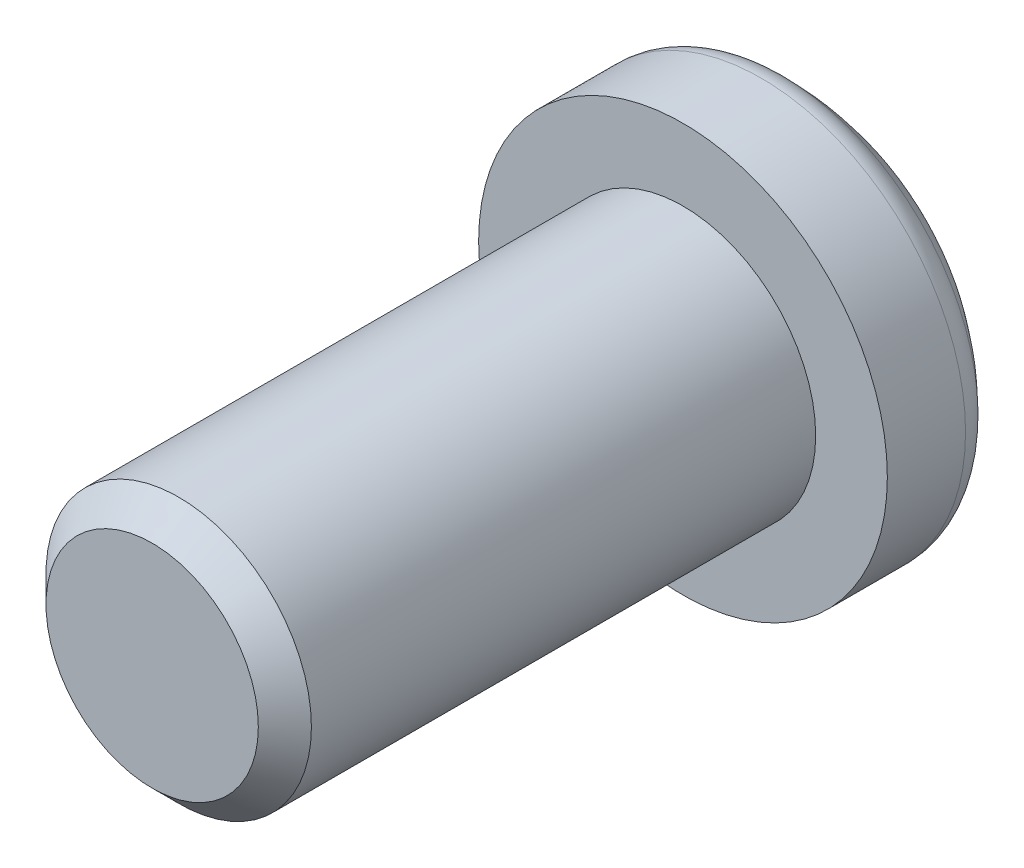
ISO-10303-21;
HEADER;
FILE_DESCRIPTION(('STEP AP214'),'2;1');
FILE_NAME('part.step','',(''),(''),'','','');
FILE_SCHEMA(('AUTOMOTIVE_DESIGN { 1 0 10303 214 1 1 1 1 }'));
ENDSEC;
DATA;
#1=APPLICATION_CONTEXT('core data for automotive mechanical design processes');
#2=APPLICATION_PROTOCOL_DEFINITION('international standard','automotive_design',2000,#1);
#3=PRODUCT_CONTEXT('',#1,'mechanical');
#4=PRODUCT('Part','Part','',(#3));
#5=PRODUCT_RELATED_PRODUCT_CATEGORY('part','',(#4));
#6=PRODUCT_DEFINITION_FORMATION('','',#4);
#7=PRODUCT_DEFINITION_CONTEXT('part definition',#1,'design');
#8=PRODUCT_DEFINITION('design','',#6,#7);
#9=PRODUCT_DEFINITION_SHAPE('','',#8);
#10=(LENGTH_UNIT() NAMED_UNIT(*) SI_UNIT(.MILLI.,.METRE.));
#11=(NAMED_UNIT(*) PLANE_ANGLE_UNIT() SI_UNIT($,.RADIAN.));
#12=(NAMED_UNIT(*) SI_UNIT($,.STERADIAN.) SOLID_ANGLE_UNIT());
#13=UNCERTAINTY_MEASURE_WITH_UNIT(LENGTH_MEASURE(1.E-05),#10,'distance_accuracy_value','');
#14=(GEOMETRIC_REPRESENTATION_CONTEXT(3) GLOBAL_UNCERTAINTY_ASSIGNED_CONTEXT((#13)) GLOBAL_UNIT_ASSIGNED_CONTEXT((#10,
#11,#12)) REPRESENTATION_CONTEXT('',''));
#15=CARTESIAN_POINT('',(0.,0.,0.));
#16=DIRECTION('',(0.,0.,1.));
#17=DIRECTION('',(1.,0.,0.));
#18=AXIS2_PLACEMENT_3D('',#15,#16,#17);
#19=CARTESIAN_POINT('',(0.,0.,1.80955882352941));
#20=DIRECTION('',(0.,0.,-1.));
#21=DIRECTION('',(1.,0.,0.));
#22=AXIS2_PLACEMENT_3D('',#19,#20,#21);
#23=SPHERICAL_SURFACE('',#22,5.20955882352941);
#24=CARTESIAN_POINT('',(0.,0.,-1.87380453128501));
#25=DIRECTION('',(0.,0.,-1.));
#26=DIRECTION('',(-1.,0.,0.));
#27=AXIS2_PLACEMENT_3D('',#24,#25,#26);
#28=CIRCLE('',#27,3.68406535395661);
#29=CARTESIAN_POINT('',(-3.68406535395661,0.,-1.87380453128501));
#30=VERTEX_POINT('',#29);
#31=EDGE_CURVE('E203',#30,#30,#28,.T.);
#32=ORIENTED_EDGE('',*,*,#31,.T.);
#33=EDGE_LOOP('',(#32));
#34=FACE_BOUND('',#33,.T.);
#35=CARTESIAN_POINT('',(-2.35,0.,1.80955882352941));
#36=DIRECTION('',(1.,0.,0.));
#37=DIRECTION('',(0.,0.,-1.));
#38=AXIS2_PLACEMENT_3D('',#35,#36,#37);
#39=CIRCLE('',#38,4.64940890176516);
#40=CARTESIAN_POINT('',(-2.35,-0.6,-2.80097293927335));
#41=VERTEX_POINT('',#40);
#42=CARTESIAN_POINT('',(-2.35,0.6,-2.80097293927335));
#43=VERTEX_POINT('',#42);
#44=EDGE_CURVE('E227',#41,#43,#39,.T.);
#45=ORIENTED_EDGE('',*,*,#44,.F.);
#46=CARTESIAN_POINT('',(0.,-0.6,1.80955882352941));
#47=DIRECTION('',(0.,1.,0.));
#48=DIRECTION('',(-1.,0.,0.));
#49=AXIS2_PLACEMENT_3D('',#46,#47,#48);
#50=CIRCLE('',#49,5.17489160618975);
#51=CARTESIAN_POINT('',(-0.6,-0.6,-3.33043175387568));
#52=VERTEX_POINT('',#51);
#53=EDGE_CURVE('E52',#52,#41,#50,.T.);
#54=ORIENTED_EDGE('',*,*,#53,.F.);
#55=CARTESIAN_POINT('',(-0.6,0.,1.80955882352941));
#56=DIRECTION('',(1.,0.,0.));
#57=DIRECTION('',(0.,1.,0.));
#58=AXIS2_PLACEMENT_3D('',#55,#56,#57);
#59=CIRCLE('',#58,5.17489160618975);
#60=CARTESIAN_POINT('',(-0.6,-2.35,-2.80097293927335));
#61=VERTEX_POINT('',#60);
#62=EDGE_CURVE('E224',#61,#52,#59,.T.);
#63=ORIENTED_EDGE('',*,*,#62,.F.);
#64=CARTESIAN_POINT('',(0.,-2.35,1.80955882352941));
#65=DIRECTION('',(0.,1.,0.));
#66=DIRECTION('',(0.,0.,1.));
#67=AXIS2_PLACEMENT_3D('',#64,#65,#66);
#68=CIRCLE('',#67,4.64940890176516);
#69=CARTESIAN_POINT('',(0.6,-2.35,-2.80097293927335));
#70=VERTEX_POINT('',#69);
#71=EDGE_CURVE('E222',#70,#61,#68,.T.);
#72=ORIENTED_EDGE('',*,*,#71,.F.);
#73=CARTESIAN_POINT('',(0.6,0.,1.80955882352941));
#74=DIRECTION('',(-1.,0.,0.));
#75=DIRECTION('',(0.,-1.,0.));
#76=AXIS2_PLACEMENT_3D('',#73,#74,#75);
#77=CIRCLE('',#76,5.17489160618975);
#78=CARTESIAN_POINT('',(0.6,-0.6,-3.33043175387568));
#79=VERTEX_POINT('',#78);
#80=EDGE_CURVE('E220',#79,#70,#77,.T.);
#81=ORIENTED_EDGE('',*,*,#80,.F.);
#82=CARTESIAN_POINT('',(0.,-0.6,1.80955882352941));
#83=DIRECTION('',(0.,1.,0.));
#84=DIRECTION('',(-1.,0.,0.));
#85=AXIS2_PLACEMENT_3D('',#82,#83,#84);
#86=CIRCLE('',#85,5.17489160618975);
#87=CARTESIAN_POINT('',(2.35,-0.6,-2.80097293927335));
#88=VERTEX_POINT('',#87);
#89=EDGE_CURVE('E218',#88,#79,#86,.T.);
#90=ORIENTED_EDGE('',*,*,#89,.F.);
#91=CARTESIAN_POINT('',(2.35,0.,1.80955882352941));
#92=DIRECTION('',(-1.,0.,0.));
#93=DIRECTION('',(0.,-1.,0.));
#94=AXIS2_PLACEMENT_3D('',#91,#92,#93);
#95=CIRCLE('',#94,4.64940890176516);
#96=CARTESIAN_POINT('',(2.35,0.6,-2.80097293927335));
#97=VERTEX_POINT('',#96);
#98=EDGE_CURVE('E216',#97,#88,#95,.T.);
#99=ORIENTED_EDGE('',*,*,#98,.F.);
#100=CARTESIAN_POINT('',(0.,0.6,1.80955882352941));
#101=DIRECTION('',(0.,-1.,0.));
#102=DIRECTION('',(1.,0.,0.));
#103=AXIS2_PLACEMENT_3D('',#100,#101,#102);
#104=CIRCLE('',#103,5.17489160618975);
#105=CARTESIAN_POINT('',(0.6,0.6,-3.33043175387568));
#106=VERTEX_POINT('',#105);
#107=EDGE_CURVE('E214',#106,#97,#104,.T.);
#108=ORIENTED_EDGE('',*,*,#107,.F.);
#109=CARTESIAN_POINT('',(0.6,0.,1.80955882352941));
#110=DIRECTION('',(-1.,0.,0.));
#111=DIRECTION('',(0.,-1.,0.));
#112=AXIS2_PLACEMENT_3D('',#109,#110,#111);
#113=CIRCLE('',#112,5.17489160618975);
#114=CARTESIAN_POINT('',(0.6,2.35,-2.80097293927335));
#115=VERTEX_POINT('',#114);
#116=EDGE_CURVE('E212',#115,#106,#113,.T.);
#117=ORIENTED_EDGE('',*,*,#116,.F.);
#118=CARTESIAN_POINT('',(0.,2.35,1.80955882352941));
#119=DIRECTION('',(0.,-1.,0.));
#120=DIRECTION('',(0.,0.,-1.));
#121=AXIS2_PLACEMENT_3D('',#118,#119,#120);
#122=CIRCLE('',#121,4.64940890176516);
#123=CARTESIAN_POINT('',(-0.6,2.35,-2.80097293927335));
#124=VERTEX_POINT('',#123);
#125=EDGE_CURVE('E210',#124,#115,#122,.T.);
#126=ORIENTED_EDGE('',*,*,#125,.F.);
#127=CARTESIAN_POINT('',(-0.6,0.,1.80955882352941));
#128=DIRECTION('',(1.,0.,0.));
#129=DIRECTION('',(0.,1.,0.));
#130=AXIS2_PLACEMENT_3D('',#127,#128,#129);
#131=CIRCLE('',#130,5.17489160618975);
#132=CARTESIAN_POINT('',(-0.6,0.6,-3.33043175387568));
#133=VERTEX_POINT('',#132);
#134=EDGE_CURVE('E208',#133,#124,#131,.T.);
#135=ORIENTED_EDGE('',*,*,#134,.F.);
#136=CARTESIAN_POINT('',(0.,0.6,1.80955882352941));
#137=DIRECTION('',(0.,-1.,0.));
#138=DIRECTION('',(1.,0.,0.));
#139=AXIS2_PLACEMENT_3D('',#136,#137,#138);
#140=CIRCLE('',#139,5.17489160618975);
#141=EDGE_CURVE('E206',#43,#133,#140,.T.);
#142=ORIENTED_EDGE('',*,*,#141,.F.);
#143=EDGE_LOOP('',(#45,#54,#63,#72,#81,#90,#99,#108,#117,#126,#135,#142));
#144=FACE_BOUND('',#143,.T.);
#145=ADVANCED_FACE('F30',(#34,#144),#23,.T.);
#146=CARTESIAN_POINT('',(0.,0.,-1.47314887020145));
#147=DIRECTION('',(0.,0.,-1.));
#148=DIRECTION('',(-1.,0.,0.));
#149=AXIS2_PLACEMENT_3D('',#146,#147,#148);
#150=TOROIDAL_SURFACE('',#149,3.28333333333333,0.566666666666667);
#151=ORIENTED_EDGE('',*,*,#31,.F.);
#152=EDGE_LOOP('',(#151));
#153=FACE_BOUND('',#152,.T.);
#154=CARTESIAN_POINT('',(0.,0.,-1.47314887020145));
#155=DIRECTION('',(0.,0.,-1.));
#156=DIRECTION('',(-1.,0.,0.));
#157=AXIS2_PLACEMENT_3D('',#154,#155,#156);
#158=CIRCLE('',#157,3.85);
#159=CARTESIAN_POINT('',(-3.85,0.,-1.47314887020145));
#160=VERTEX_POINT('',#159);
#161=EDGE_CURVE('E200',#160,#160,#158,.T.);
#162=ORIENTED_EDGE('',*,*,#161,.T.);
#163=EDGE_LOOP('',(#162));
#164=FACE_BOUND('',#163,.T.);
#165=ADVANCED_FACE('F247',(#153,#164),#150,.T.);
#166=CARTESIAN_POINT('',(0.,0.,0.));
#167=DIRECTION('',(0.,0.,-1.));
#168=DIRECTION('',(-1.,0.,0.));
#169=AXIS2_PLACEMENT_3D('',#166,#167,#168);
#170=CYLINDRICAL_SURFACE('',#169,3.85);
#171=ORIENTED_EDGE('',*,*,#161,.F.);
#172=EDGE_LOOP('',(#171));
#173=FACE_BOUND('',#172,.T.);
#174=CARTESIAN_POINT('',(0.,0.,0.));
#175=DIRECTION('',(0.,0.,-1.));
#176=DIRECTION('',(-1.,0.,0.));
#177=AXIS2_PLACEMENT_3D('',#174,#175,#176);
#178=CIRCLE('',#177,3.85);
#179=CARTESIAN_POINT('',(-3.85,0.,0.));
#180=VERTEX_POINT('',#179);
#181=EDGE_CURVE('E125',#180,#180,#178,.T.);
#182=ORIENTED_EDGE('',*,*,#181,.T.);
#183=EDGE_LOOP('',(#182));
#184=FACE_BOUND('',#183,.T.);
#185=ADVANCED_FACE('F252',(#173,#184),#170,.T.);
#186=CARTESIAN_POINT('',(0.,0.,0.));
#187=DIRECTION('',(0.,0.,-1.));
#188=DIRECTION('',(-1.,0.,0.));
#189=AXIS2_PLACEMENT_3D('',#186,#187,#188);
#190=PLANE('',#189);
#191=CARTESIAN_POINT('',(0.,0.,0.));
#192=DIRECTION('',(0.,0.,1.));
#193=DIRECTION('',(1.,0.,0.));
#194=AXIS2_PLACEMENT_3D('',#191,#192,#193);
#195=CIRCLE('',#194,2.5);
#196=CARTESIAN_POINT('',(2.5,0.,0.));
#197=VERTEX_POINT('',#196);
#198=EDGE_CURVE('E166',#197,#197,#195,.T.);
#199=ORIENTED_EDGE('',*,*,#198,.F.);
#200=EDGE_LOOP('',(#199));
#201=FACE_BOUND('',#200,.T.);
#202=ORIENTED_EDGE('',*,*,#181,.F.);
#203=EDGE_LOOP('',(#202));
#204=FACE_BOUND('',#203,.T.);
#205=ADVANCED_FACE('F307',(#201,#204),#190,.F.);
#206=CARTESIAN_POINT('',(-2.35,0.6,-2.2));
#207=DIRECTION('',(1.,0.,0.));
#208=DIRECTION('',(0.,0.,-1.));
#209=AXIS2_PLACEMENT_3D('',#206,#207,#208);
#210=PLANE('',#209);
#211=ORIENTED_EDGE('',*,*,#44,.T.);
#212=DIRECTION('',(0.,0.,-1.));
#213=VECTOR('',#212,1.);
#214=CARTESIAN_POINT('',(-2.35,0.6,-2.2));
#215=LINE('',#214,#213);
#216=CARTESIAN_POINT('',(-2.35,0.6,-0.2));
#217=VERTEX_POINT('',#216);
#218=EDGE_CURVE('E44',#217,#43,#215,.T.);
#219=ORIENTED_EDGE('',*,*,#218,.F.);
#220=DIRECTION('',(0.,1.,0.));
#221=VECTOR('',#220,1.);
#222=CARTESIAN_POINT('',(-2.35,-0.6,-0.2));
#223=LINE('',#222,#221);
#224=CARTESIAN_POINT('',(-2.35,-0.6,-0.2));
#225=VERTEX_POINT('',#224);
#226=EDGE_CURVE('E129',#225,#217,#223,.T.);
#227=ORIENTED_EDGE('',*,*,#226,.F.);
#228=DIRECTION('',(0.,0.,-1.));
#229=VECTOR('',#228,1.);
#230=CARTESIAN_POINT('',(-2.35,-0.6,-2.2));
#231=LINE('',#230,#229);
#232=EDGE_CURVE('E117',#225,#41,#231,.T.);
#233=ORIENTED_EDGE('',*,*,#232,.T.);
#234=EDGE_LOOP('',(#211,#219,#227,#233));
#235=FACE_BOUND('',#234,.T.);
#236=ADVANCED_FACE('F130',(#235),#210,.T.);
#237=CARTESIAN_POINT('',(-2.35,-0.6,-2.2));
#238=DIRECTION('',(0.,1.,0.));
#239=DIRECTION('',(-1.,0.,0.));
#240=AXIS2_PLACEMENT_3D('',#237,#238,#239);
#241=PLANE('',#240);
#242=ORIENTED_EDGE('',*,*,#53,.T.);
#243=ORIENTED_EDGE('',*,*,#232,.F.);
#244=DIRECTION('',(-1.,0.,0.));
#245=VECTOR('',#244,1.);
#246=CARTESIAN_POINT('',(-0.6,-0.6,-0.2));
#247=LINE('',#246,#245);
#248=CARTESIAN_POINT('',(-0.6,-0.6,-0.2));
#249=VERTEX_POINT('',#248);
#250=EDGE_CURVE('E121',#249,#225,#247,.T.);
#251=ORIENTED_EDGE('',*,*,#250,.F.);
#252=DIRECTION('',(0.,0.,-1.));
#253=VECTOR('',#252,1.);
#254=CARTESIAN_POINT('',(-0.6,-0.6,-2.2));
#255=LINE('',#254,#253);
#256=EDGE_CURVE('E126',#249,#52,#255,.T.);
#257=ORIENTED_EDGE('',*,*,#256,.T.);
#258=EDGE_LOOP('',(#242,#243,#251,#257));
#259=FACE_BOUND('',#258,.T.);
#260=ADVANCED_FACE('F119',(#259),#241,.T.);
#261=CARTESIAN_POINT('',(-0.6,-0.6,-2.2));
#262=DIRECTION('',(1.,0.,0.));
#263=DIRECTION('',(0.,1.,0.));
#264=AXIS2_PLACEMENT_3D('',#261,#262,#263);
#265=PLANE('',#264);
#266=ORIENTED_EDGE('',*,*,#62,.T.);
#267=ORIENTED_EDGE('',*,*,#256,.F.);
#268=DIRECTION('',(0.,1.,0.));
#269=VECTOR('',#268,1.);
#270=CARTESIAN_POINT('',(-0.6,-2.35,-0.2));
#271=LINE('',#270,#269);
#272=CARTESIAN_POINT('',(-0.6,-2.35,-0.2));
#273=VERTEX_POINT('',#272);
#274=EDGE_CURVE('E138',#273,#249,#271,.T.);
#275=ORIENTED_EDGE('',*,*,#274,.F.);
#276=DIRECTION('',(0.,0.,-1.));
#277=VECTOR('',#276,1.);
#278=CARTESIAN_POINT('',(-0.6,-2.35,-2.2));
#279=LINE('',#278,#277);
#280=EDGE_CURVE('E194',#273,#61,#279,.T.);
#281=ORIENTED_EDGE('',*,*,#280,.T.);
#282=EDGE_LOOP('',(#266,#267,#275,#281));
#283=FACE_BOUND('',#282,.T.);
#284=ADVANCED_FACE('F290',(#283),#265,.T.);
#285=CARTESIAN_POINT('',(-0.6,-2.35,-2.2));
#286=DIRECTION('',(0.,1.,0.));
#287=DIRECTION('',(0.,0.,1.));
#288=AXIS2_PLACEMENT_3D('',#285,#286,#287);
#289=PLANE('',#288);
#290=ORIENTED_EDGE('',*,*,#71,.T.);
#291=ORIENTED_EDGE('',*,*,#280,.F.);
#292=DIRECTION('',(-1.,0.,0.));
#293=VECTOR('',#292,1.);
#294=CARTESIAN_POINT('',(0.6,-2.35,-0.2));
#295=LINE('',#294,#293);
#296=CARTESIAN_POINT('',(0.6,-2.35,-0.2));
#297=VERTEX_POINT('',#296);
#298=EDGE_CURVE('E163',#297,#273,#295,.T.);
#299=ORIENTED_EDGE('',*,*,#298,.F.);
#300=DIRECTION('',(0.,0.,-1.));
#301=VECTOR('',#300,1.);
#302=CARTESIAN_POINT('',(0.6,-2.35,-2.2));
#303=LINE('',#302,#301);
#304=EDGE_CURVE('E191',#297,#70,#303,.T.);
#305=ORIENTED_EDGE('',*,*,#304,.T.);
#306=EDGE_LOOP('',(#290,#291,#299,#305));
#307=FACE_BOUND('',#306,.T.);
#308=ADVANCED_FACE('F292',(#307),#289,.T.);
#309=CARTESIAN_POINT('',(0.6,-0.6,-2.2));
#310=DIRECTION('',(-1.,0.,0.));
#311=DIRECTION('',(0.,-1.,0.));
#312=AXIS2_PLACEMENT_3D('',#309,#310,#311);
#313=PLANE('',#312);
#314=ORIENTED_EDGE('',*,*,#80,.T.);
#315=ORIENTED_EDGE('',*,*,#304,.F.);
#316=DIRECTION('',(0.,-1.,0.));
#317=VECTOR('',#316,1.);
#318=CARTESIAN_POINT('',(0.6,-0.6,-0.2));
#319=LINE('',#318,#317);
#320=CARTESIAN_POINT('',(0.6,-0.6,-0.2));
#321=VERTEX_POINT('',#320);
#322=EDGE_CURVE('E160',#321,#297,#319,.T.);
#323=ORIENTED_EDGE('',*,*,#322,.F.);
#324=DIRECTION('',(0.,0.,-1.));
#325=VECTOR('',#324,1.);
#326=CARTESIAN_POINT('',(0.6,-0.6,-2.2));
#327=LINE('',#326,#325);
#328=EDGE_CURVE('E188',#321,#79,#327,.T.);
#329=ORIENTED_EDGE('',*,*,#328,.T.);
#330=EDGE_LOOP('',(#314,#315,#323,#329));
#331=FACE_BOUND('',#330,.T.);
#332=ADVANCED_FACE('F286',(#331),#313,.T.);
#333=CARTESIAN_POINT('',(0.6,-0.6,-2.2));
#334=DIRECTION('',(0.,1.,0.));
#335=DIRECTION('',(-1.,0.,0.));
#336=AXIS2_PLACEMENT_3D('',#333,#334,#335);
#337=PLANE('',#336);
#338=ORIENTED_EDGE('',*,*,#89,.T.);
#339=ORIENTED_EDGE('',*,*,#328,.F.);
#340=DIRECTION('',(-1.,0.,0.));
#341=VECTOR('',#340,1.);
#342=CARTESIAN_POINT('',(2.35,-0.6,-0.2));
#343=LINE('',#342,#341);
#344=CARTESIAN_POINT('',(2.35,-0.6,-0.2));
#345=VERTEX_POINT('',#344);
#346=EDGE_CURVE('E157',#345,#321,#343,.T.);
#347=ORIENTED_EDGE('',*,*,#346,.F.);
#348=DIRECTION('',(0.,0.,-1.));
#349=VECTOR('',#348,1.);
#350=CARTESIAN_POINT('',(2.35,-0.6,-2.2));
#351=LINE('',#350,#349);
#352=EDGE_CURVE('E185',#345,#88,#351,.T.);
#353=ORIENTED_EDGE('',*,*,#352,.T.);
#354=EDGE_LOOP('',(#338,#339,#347,#353));
#355=FACE_BOUND('',#354,.T.);
#356=ADVANCED_FACE('F282',(#355),#337,.T.);
#357=CARTESIAN_POINT('',(2.35,0.6,-2.2));
#358=DIRECTION('',(-1.,0.,0.));
#359=DIRECTION('',(0.,-1.,0.));
#360=AXIS2_PLACEMENT_3D('',#357,#358,#359);
#361=PLANE('',#360);
#362=ORIENTED_EDGE('',*,*,#98,.T.);
#363=ORIENTED_EDGE('',*,*,#352,.F.);
#364=DIRECTION('',(0.,-1.,0.));
#365=VECTOR('',#364,1.);
#366=CARTESIAN_POINT('',(2.35,0.6,-0.2));
#367=LINE('',#366,#365);
#368=CARTESIAN_POINT('',(2.35,0.6,-0.2));
#369=VERTEX_POINT('',#368);
#370=EDGE_CURVE('E154',#369,#345,#367,.T.);
#371=ORIENTED_EDGE('',*,*,#370,.F.);
#372=DIRECTION('',(0.,0.,-1.));
#373=VECTOR('',#372,1.);
#374=CARTESIAN_POINT('',(2.35,0.6,-2.2));
#375=LINE('',#374,#373);
#376=EDGE_CURVE('E182',#369,#97,#375,.T.);
#377=ORIENTED_EDGE('',*,*,#376,.T.);
#378=EDGE_LOOP('',(#362,#363,#371,#377));
#379=FACE_BOUND('',#378,.T.);
#380=ADVANCED_FACE('F278',(#379),#361,.T.);
#381=CARTESIAN_POINT('',(0.6,0.6,-2.2));
#382=DIRECTION('',(0.,-1.,0.));
#383=DIRECTION('',(1.,0.,0.));
#384=AXIS2_PLACEMENT_3D('',#381,#382,#383);
#385=PLANE('',#384);
#386=ORIENTED_EDGE('',*,*,#107,.T.);
#387=ORIENTED_EDGE('',*,*,#376,.F.);
#388=DIRECTION('',(1.,0.,0.));
#389=VECTOR('',#388,1.);
#390=CARTESIAN_POINT('',(0.6,0.6,-0.2));
#391=LINE('',#390,#389);
#392=CARTESIAN_POINT('',(0.6,0.6,-0.2));
#393=VERTEX_POINT('',#392);
#394=EDGE_CURVE('E151',#393,#369,#391,.T.);
#395=ORIENTED_EDGE('',*,*,#394,.F.);
#396=DIRECTION('',(0.,0.,-1.));
#397=VECTOR('',#396,1.);
#398=CARTESIAN_POINT('',(0.6,0.6,-2.2));
#399=LINE('',#398,#397);
#400=EDGE_CURVE('E179',#393,#106,#399,.T.);
#401=ORIENTED_EDGE('',*,*,#400,.T.);
#402=EDGE_LOOP('',(#386,#387,#395,#401));
#403=FACE_BOUND('',#402,.T.);
#404=ADVANCED_FACE('F274',(#403),#385,.T.);
#405=CARTESIAN_POINT('',(0.6,2.35,-2.2));
#406=DIRECTION('',(-1.,0.,0.));
#407=DIRECTION('',(0.,-1.,0.));
#408=AXIS2_PLACEMENT_3D('',#405,#406,#407);
#409=PLANE('',#408);
#410=ORIENTED_EDGE('',*,*,#116,.T.);
#411=ORIENTED_EDGE('',*,*,#400,.F.);
#412=DIRECTION('',(0.,-1.,0.));
#413=VECTOR('',#412,1.);
#414=CARTESIAN_POINT('',(0.6,2.35,-0.2));
#415=LINE('',#414,#413);
#416=CARTESIAN_POINT('',(0.6,2.35,-0.2));
#417=VERTEX_POINT('',#416);
#418=EDGE_CURVE('E148',#417,#393,#415,.T.);
#419=ORIENTED_EDGE('',*,*,#418,.F.);
#420=DIRECTION('',(0.,0.,-1.));
#421=VECTOR('',#420,1.);
#422=CARTESIAN_POINT('',(0.6,2.35,-2.2));
#423=LINE('',#422,#421);
#424=EDGE_CURVE('E176',#417,#115,#423,.T.);
#425=ORIENTED_EDGE('',*,*,#424,.T.);
#426=EDGE_LOOP('',(#410,#411,#419,#425));
#427=FACE_BOUND('',#426,.T.);
#428=ADVANCED_FACE('F270',(#427),#409,.T.);
#429=CARTESIAN_POINT('',(-0.6,2.35,-2.2));
#430=DIRECTION('',(0.,-1.,0.));
#431=DIRECTION('',(0.,0.,-1.));
#432=AXIS2_PLACEMENT_3D('',#429,#430,#431);
#433=PLANE('',#432);
#434=ORIENTED_EDGE('',*,*,#125,.T.);
#435=ORIENTED_EDGE('',*,*,#424,.F.);
#436=DIRECTION('',(1.,0.,0.));
#437=VECTOR('',#436,1.);
#438=CARTESIAN_POINT('',(-0.6,2.35,-0.2));
#439=LINE('',#438,#437);
#440=CARTESIAN_POINT('',(-0.6,2.35,-0.2));
#441=VERTEX_POINT('',#440);
#442=EDGE_CURVE('E145',#441,#417,#439,.T.);
#443=ORIENTED_EDGE('',*,*,#442,.F.);
#444=DIRECTION('',(0.,0.,-1.));
#445=VECTOR('',#444,1.);
#446=CARTESIAN_POINT('',(-0.6,2.35,-2.2));
#447=LINE('',#446,#445);
#448=EDGE_CURVE('E173',#441,#124,#447,.T.);
#449=ORIENTED_EDGE('',*,*,#448,.T.);
#450=EDGE_LOOP('',(#434,#435,#443,#449));
#451=FACE_BOUND('',#450,.T.);
#452=ADVANCED_FACE('F267',(#451),#433,.T.);
#453=CARTESIAN_POINT('',(-0.6,2.35,-2.2));
#454=DIRECTION('',(1.,0.,0.));
#455=DIRECTION('',(0.,1.,0.));
#456=AXIS2_PLACEMENT_3D('',#453,#454,#455);
#457=PLANE('',#456);
#458=ORIENTED_EDGE('',*,*,#134,.T.);
#459=ORIENTED_EDGE('',*,*,#448,.F.);
#460=DIRECTION('',(0.,1.,0.));
#461=VECTOR('',#460,1.);
#462=CARTESIAN_POINT('',(-0.6,0.6,-0.2));
#463=LINE('',#462,#461);
#464=CARTESIAN_POINT('',(-0.6,0.6,-0.2));
#465=VERTEX_POINT('',#464);
#466=EDGE_CURVE('E142',#465,#441,#463,.T.);
#467=ORIENTED_EDGE('',*,*,#466,.F.);
#468=DIRECTION('',(0.,0.,-1.));
#469=VECTOR('',#468,1.);
#470=CARTESIAN_POINT('',(-0.6,0.6,-2.2));
#471=LINE('',#470,#469);
#472=EDGE_CURVE('E170',#465,#133,#471,.T.);
#473=ORIENTED_EDGE('',*,*,#472,.T.);
#474=EDGE_LOOP('',(#458,#459,#467,#473));
#475=FACE_BOUND('',#474,.T.);
#476=ADVANCED_FACE('F263',(#475),#457,.T.);
#477=CARTESIAN_POINT('',(-2.35,0.6,-2.2));
#478=DIRECTION('',(0.,-1.,0.));
#479=DIRECTION('',(1.,0.,0.));
#480=AXIS2_PLACEMENT_3D('',#477,#478,#479);
#481=PLANE('',#480);
#482=ORIENTED_EDGE('',*,*,#141,.T.);
#483=ORIENTED_EDGE('',*,*,#472,.F.);
#484=DIRECTION('',(1.,0.,0.));
#485=VECTOR('',#484,1.);
#486=CARTESIAN_POINT('',(-2.35,0.6,-0.2));
#487=LINE('',#486,#485);
#488=EDGE_CURVE('E133',#217,#465,#487,.T.);
#489=ORIENTED_EDGE('',*,*,#488,.F.);
#490=ORIENTED_EDGE('',*,*,#218,.T.);
#491=EDGE_LOOP('',(#482,#483,#489,#490));
#492=FACE_BOUND('',#491,.T.);
#493=ADVANCED_FACE('F260',(#492),#481,.T.);
#494=CARTESIAN_POINT('',(0.,0.,10.));
#495=DIRECTION('',(0.,0.,1.));
#496=DIRECTION('',(1.,0.,0.));
#497=AXIS2_PLACEMENT_3D('',#494,#495,#496);
#498=PLANE('',#497);
#499=CARTESIAN_POINT('',(0.,0.,10.));
#500=DIRECTION('',(0.,0.,1.));
#501=DIRECTION('',(1.,0.,0.));
#502=AXIS2_PLACEMENT_3D('',#499,#500,#501);
#503=CIRCLE('',#502,2.);
#504=CARTESIAN_POINT('',(2.,0.,10.));
#505=VERTEX_POINT('',#504);
#506=EDGE_CURVE('E37',#505,#505,#503,.T.);
#507=ORIENTED_EDGE('',*,*,#506,.T.);
#508=EDGE_LOOP('',(#507));
#509=FACE_BOUND('',#508,.T.);
#510=ADVANCED_FACE('F231',(#509),#498,.T.);
#511=CARTESIAN_POINT('',(0.,0.,0.));
#512=DIRECTION('',(0.,0.,1.));
#513=DIRECTION('',(1.,0.,0.));
#514=AXIS2_PLACEMENT_3D('',#511,#512,#513);
#515=CYLINDRICAL_SURFACE('',#514,2.5);
#516=CARTESIAN_POINT('',(0.,0.,9.5));
#517=DIRECTION('',(0.,0.,1.));
#518=DIRECTION('',(1.,0.,0.));
#519=AXIS2_PLACEMENT_3D('',#516,#517,#518);
#520=CIRCLE('',#519,2.5);
#521=CARTESIAN_POINT('',(2.5,0.,9.5));
#522=VERTEX_POINT('',#521);
#523=EDGE_CURVE('E11',#522,#522,#520,.F.);
#524=ORIENTED_EDGE('',*,*,#523,.T.);
#525=EDGE_LOOP('',(#524));
#526=FACE_BOUND('',#525,.T.);
#527=ORIENTED_EDGE('',*,*,#198,.T.);
#528=EDGE_LOOP('',(#527));
#529=FACE_BOUND('',#528,.T.);
#530=ADVANCED_FACE('F235',(#526,#529),#515,.T.);
#531=CARTESIAN_POINT('',(0.,0.,10.));
#532=DIRECTION('',(0.,0.,-1.));
#533=DIRECTION('',(-1.,0.,0.));
#534=AXIS2_PLACEMENT_3D('',#531,#532,#533);
#535=CONICAL_SURFACE('',#534,2.,0.785398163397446);
#536=ORIENTED_EDGE('',*,*,#523,.F.);
#537=EDGE_LOOP('',(#536));
#538=FACE_BOUND('',#537,.T.);
#539=ORIENTED_EDGE('',*,*,#506,.F.);
#540=EDGE_LOOP('',(#539));
#541=FACE_BOUND('',#540,.T.);
#542=ADVANCED_FACE('F233',(#538,#541),#535,.T.);
#543=CARTESIAN_POINT('',(0.6,-0.6,-0.2));
#544=DIRECTION('',(0.,0.,1.));
#545=DIRECTION('',(1.,0.,0.));
#546=AXIS2_PLACEMENT_3D('',#543,#544,#545);
#547=PLANE('',#546);
#548=ORIENTED_EDGE('',*,*,#250,.T.);
#549=ORIENTED_EDGE('',*,*,#226,.T.);
#550=ORIENTED_EDGE('',*,*,#488,.T.);
#551=ORIENTED_EDGE('',*,*,#466,.T.);
#552=ORIENTED_EDGE('',*,*,#442,.T.);
#553=ORIENTED_EDGE('',*,*,#418,.T.);
#554=ORIENTED_EDGE('',*,*,#394,.T.);
#555=ORIENTED_EDGE('',*,*,#370,.T.);
#556=ORIENTED_EDGE('',*,*,#346,.T.);
#557=ORIENTED_EDGE('',*,*,#322,.T.);
#558=ORIENTED_EDGE('',*,*,#298,.T.);
#559=ORIENTED_EDGE('',*,*,#274,.T.);
#560=EDGE_LOOP('',(#548,#549,#550,#551,#552,#553,#554,#555,#556,#557,#558,#559));
#561=FACE_BOUND('',#560,.T.);
#562=ADVANCED_FACE('F135',(#561),#547,.F.);
#563=CLOSED_SHELL('',(#145,#165,#185,#205,#236,#260,#284,#308,#332,#356,#380,#404,#428,#452,
#476,#493,#510,#530,#542,#562));
#564=MANIFOLD_SOLID_BREP('B2',#563);
#565=ADVANCED_BREP_SHAPE_REPRESENTATION('',(#18,#564),#14);
#566=SHAPE_DEFINITION_REPRESENTATION(#9,#565);
ENDSEC;
END-ISO-10303-21;
